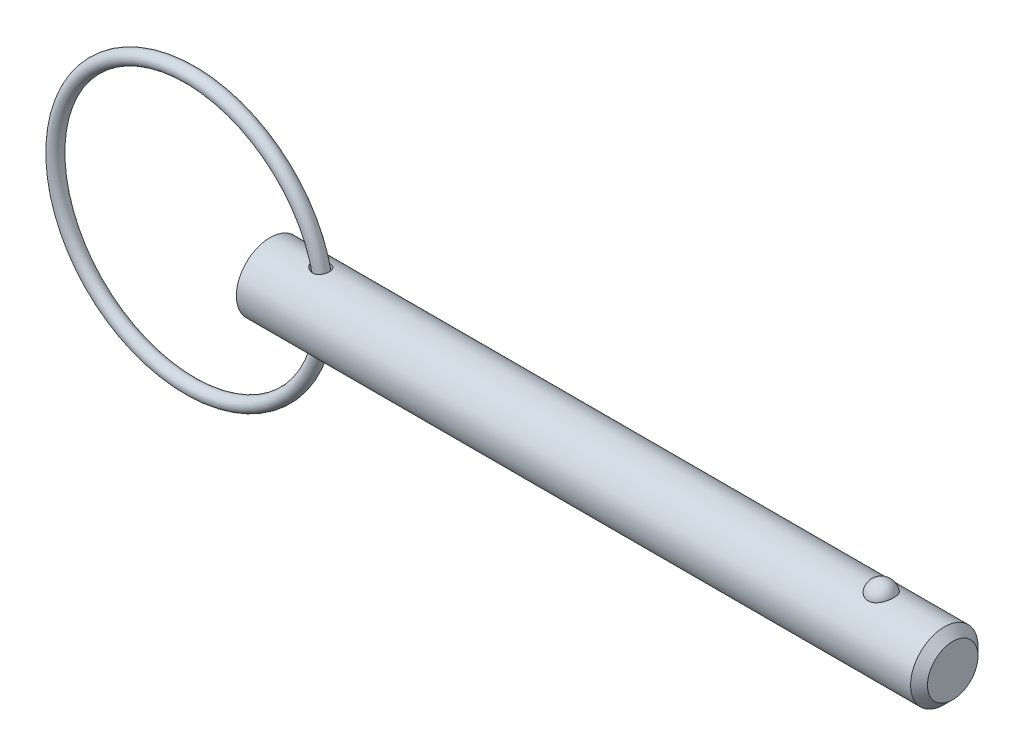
ISO-10303-21;
HEADER;
FILE_DESCRIPTION(('STEP AP214'),'2;1');
FILE_NAME('part.step','',(''),(''),'','','');
FILE_SCHEMA(('AUTOMOTIVE_DESIGN { 1 0 10303 214 1 1 1 1 }'));
ENDSEC;
DATA;
#1=APPLICATION_CONTEXT('core data for automotive mechanical design processes');
#2=APPLICATION_PROTOCOL_DEFINITION('international standard','automotive_design',2000,#1);
#3=PRODUCT_CONTEXT('',#1,'mechanical');
#4=PRODUCT('Part','Part','',(#3));
#5=PRODUCT_RELATED_PRODUCT_CATEGORY('part','',(#4));
#6=PRODUCT_DEFINITION_FORMATION('','',#4);
#7=PRODUCT_DEFINITION_CONTEXT('part definition',#1,'design');
#8=PRODUCT_DEFINITION('design','',#6,#7);
#9=PRODUCT_DEFINITION_SHAPE('','',#8);
#10=(LENGTH_UNIT() NAMED_UNIT(*) SI_UNIT(.MILLI.,.METRE.));
#11=(NAMED_UNIT(*) PLANE_ANGLE_UNIT() SI_UNIT($,.RADIAN.));
#12=(NAMED_UNIT(*) SI_UNIT($,.STERADIAN.) SOLID_ANGLE_UNIT());
#13=UNCERTAINTY_MEASURE_WITH_UNIT(LENGTH_MEASURE(1.E-05),#10,'distance_accuracy_value','');
#14=(GEOMETRIC_REPRESENTATION_CONTEXT(3) GLOBAL_UNCERTAINTY_ASSIGNED_CONTEXT((#13)) GLOBAL_UNIT_ASSIGNED_CONTEXT((#10,
#11,#12)) REPRESENTATION_CONTEXT('',''));
#15=CARTESIAN_POINT('',(0.,0.,0.));
#16=DIRECTION('',(0.,0.,1.));
#17=DIRECTION('',(1.,0.,0.));
#18=AXIS2_PLACEMENT_3D('',#15,#16,#17);
#19=CARTESIAN_POINT('',(-7.52490236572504,0.,0.));
#20=DIRECTION('',(0.,0.,1.));
#21=DIRECTION('',(1.,0.,0.));
#22=AXIS2_PLACEMENT_3D('',#19,#20,#21);
#23=TOROIDAL_SURFACE('',#22,12.7,0.635000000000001);
#24=CARTESIAN_POINT('',(5.81009763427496,0.,0.));
#25=VERTEX_POINT('',#24);
#26=VERTEX_LOOP('',#25);
#27=FACE_BOUND('',#26,.T.);
#28=ADVANCED_FACE('P0_F12',(#27),#23,.T.);
#29=CLOSED_SHELL('',(#28));
#30=MANIFOLD_SOLID_BREP('P0_B1',#29);
#31=CARTESIAN_POINT('',(0.,0.,0.));
#32=DIRECTION('',(1.,0.,0.));
#33=DIRECTION('',(0.,0.,-1.));
#34=AXIS2_PLACEMENT_3D('',#31,#32,#33);
#35=CYLINDRICAL_SURFACE('',#34,3.175);
#36=CARTESIAN_POINT('',(4.01221718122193,3.16142308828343,-0.293307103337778));
#37=CARTESIAN_POINT('',(4.03067993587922,3.15750982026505,-0.335477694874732));
#38=CARTESIAN_POINT('',(4.05297703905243,3.15289835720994,-0.375943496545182));
#39=CARTESIAN_POINT('',(4.10415276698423,3.14284099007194,-0.45240794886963));
#40=CARTESIAN_POINT('',(4.13304477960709,3.13739339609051,-0.488397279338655));
#41=CARTESIAN_POINT('',(4.19615348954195,3.12629932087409,-0.554988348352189));
#42=CARTESIAN_POINT('',(4.23034557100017,3.12065384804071,-0.585613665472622));
#43=CARTESIAN_POINT('',(4.30313282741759,3.10972452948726,-0.641123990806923));
#44=CARTESIAN_POINT('',(4.34172706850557,3.10444060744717,-0.666010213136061));
#45=CARTESIAN_POINT('',(4.42517725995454,3.09444053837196,-0.711079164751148));
#46=CARTESIAN_POINT('',(4.4702815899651,3.08978882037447,-0.730818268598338));
#47=CARTESIAN_POINT('',(4.56327045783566,3.08209858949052,-0.762602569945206));
#48=CARTESIAN_POINT('',(4.61115533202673,3.07906027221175,-0.774646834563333));
#49=CARTESIAN_POINT('',(4.70827322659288,3.0750396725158,-0.790458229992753));
#50=CARTESIAN_POINT('',(4.75750323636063,3.07405312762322,-0.794242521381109));
#51=CARTESIAN_POINT('',(4.85586074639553,3.07433427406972,-0.793155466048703));
#52=CARTESIAN_POINT('',(4.90498828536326,3.07560084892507,-0.788288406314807));
#53=CARTESIAN_POINT('',(4.99830385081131,3.08013122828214,-0.770385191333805));
#54=CARTESIAN_POINT('',(5.04260499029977,3.08325928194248,-0.757902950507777));
#55=CARTESIAN_POINT('',(5.12824625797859,3.09104671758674,-0.72548689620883));
#56=CARTESIAN_POINT('',(5.16958706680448,3.09570574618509,-0.705554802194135));
#57=CARTESIAN_POINT('',(5.24627719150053,3.10576748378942,-0.659813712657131));
#58=CARTESIAN_POINT('',(5.28181038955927,3.11112830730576,-0.634302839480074));
#59=CARTESIAN_POINT('',(5.34802604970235,3.12213947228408,-0.577667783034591));
#60=CARTESIAN_POINT('',(5.37870854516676,3.1277898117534,-0.54654363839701));
#61=CARTESIAN_POINT('',(5.43445707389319,3.13876145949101,-0.479533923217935));
#62=CARTESIAN_POINT('',(5.45951927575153,3.14408254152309,-0.443645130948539));
#63=CARTESIAN_POINT('',(5.50339935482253,3.15381660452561,-0.368122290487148));
#64=CARTESIAN_POINT('',(5.52221691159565,3.15822953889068,-0.328488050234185));
#65=CARTESIAN_POINT('',(5.55335622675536,3.16572312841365,-0.246075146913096));
#66=CARTESIAN_POINT('',(5.56559711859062,3.16878711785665,-0.20326439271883));
#67=CARTESIAN_POINT('',(5.58294807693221,3.17317503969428,-0.11613503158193));
#68=CARTESIAN_POINT('',(5.58805800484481,3.17449893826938,-0.0718163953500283));
#69=CARTESIAN_POINT('',(5.59103306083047,3.17526647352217,0.017234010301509));
#70=CARTESIAN_POINT('',(5.5888730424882,3.17470358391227,0.0619666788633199));
#71=CARTESIAN_POINT('',(5.57730300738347,3.17174350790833,0.150422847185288));
#72=CARTESIAN_POINT('',(5.56789286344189,3.16934628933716,0.194146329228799));
#73=CARTESIAN_POINT('',(5.54204285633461,3.16297605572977,0.279344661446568));
#74=CARTESIAN_POINT('',(5.52560272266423,3.15900298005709,0.320819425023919));
#75=CARTESIAN_POINT('',(5.48608205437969,3.14991364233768,0.400340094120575));
#76=CARTESIAN_POINT('',(5.46300145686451,3.14479736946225,0.438385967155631));
#77=CARTESIAN_POINT('',(5.41080575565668,3.1339965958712,0.509900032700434));
#78=CARTESIAN_POINT('',(5.3817004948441,3.12831302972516,0.543375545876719));
#79=CARTESIAN_POINT('',(5.31818122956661,3.11701107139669,0.604852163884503));
#80=CARTESIAN_POINT('',(5.2837678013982,3.11139267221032,0.632853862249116));
#81=CARTESIAN_POINT('',(5.21096127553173,3.10091904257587,0.682320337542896));
#82=CARTESIAN_POINT('',(5.17261393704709,3.09605639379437,0.703850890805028));
#83=CARTESIAN_POINT('',(5.09274050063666,3.08756769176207,0.740203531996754));
#84=CARTESIAN_POINT('',(5.05121474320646,3.08394150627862,0.755026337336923));
#85=CARTESIAN_POINT('',(4.96650658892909,3.07833156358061,0.777582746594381));
#86=CARTESIAN_POINT('',(4.92333841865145,3.07633606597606,0.785367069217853));
#87=CARTESIAN_POINT('',(4.83627503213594,3.07411756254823,0.794006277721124));
#88=CARTESIAN_POINT('',(4.79237971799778,3.07389479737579,0.794860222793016));
#89=CARTESIAN_POINT('',(4.7037564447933,3.0752087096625,0.789761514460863));
#90=CARTESIAN_POINT('',(4.65904075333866,3.07679607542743,0.783612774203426));
#91=CARTESIAN_POINT('',(4.57116325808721,3.08158486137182,0.764561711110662));
#92=CARTESIAN_POINT('',(4.52800197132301,3.08478681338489,0.751657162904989));
#93=CARTESIAN_POINT('',(4.44149370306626,3.09268658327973,0.718486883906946));
#94=CARTESIAN_POINT('',(4.39831651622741,3.0974680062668,0.697797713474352));
#95=CARTESIAN_POINT('',(4.31591226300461,3.10789270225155,0.649792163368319));
#96=CARTESIAN_POINT('',(4.27668695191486,3.11353635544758,0.622472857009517));
#97=CARTESIAN_POINT('',(4.20182407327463,3.1252888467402,0.560557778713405));
#98=CARTESIAN_POINT('',(4.16638921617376,3.13140725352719,0.525717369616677));
#99=CARTESIAN_POINT('',(4.10227951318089,3.14315144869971,0.450199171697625));
#100=CARTESIAN_POINT('',(4.07360231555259,3.14877740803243,0.409523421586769));
#101=CARTESIAN_POINT('',(4.02575866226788,3.15851130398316,0.32574192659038));
#102=CARTESIAN_POINT('',(4.00615248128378,3.16268619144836,0.282896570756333));
#103=CARTESIAN_POINT('',(3.97532986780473,3.16936826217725,0.194163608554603));
#104=CARTESIAN_POINT('',(3.96410589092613,3.17187694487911,0.148278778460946));
#105=CARTESIAN_POINT('',(3.95155037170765,3.17469339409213,0.0604600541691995));
#106=CARTESIAN_POINT('',(3.9492378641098,3.17521926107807,0.0186712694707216));
#107=CARTESIAN_POINT('',(3.95191506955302,3.1746144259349,-0.0646295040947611));
#108=CARTESIAN_POINT('',(3.9568961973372,3.17348567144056,-0.106141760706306));
#109=CARTESIAN_POINT('',(3.97060099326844,3.17043701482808,-0.172031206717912));
#110=CARTESIAN_POINT('',(3.97717137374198,3.16898333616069,-0.196902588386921));
#111=CARTESIAN_POINT('',(3.99283717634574,3.16556630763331,-0.245794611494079));
#112=CARTESIAN_POINT('',(4.00193224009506,3.16360303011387,-0.269815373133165));
#113=CARTESIAN_POINT('',(4.01221718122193,3.16142308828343,-0.293307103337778));
#114=B_SPLINE_CURVE_WITH_KNOTS('',3,(#36,#37,#38,#39,#40,#41,#42,#43,#44,#45,#46,#47,#48,#49,
#50,#51,#52,#53,#54,#55,#56,#57,#58,#59,#60,#61,#62,#63,#64,#65,#66,#67,#68,#69,#70,#71,#72,#73,
#74,#75,#76,#77,#78,#79,#80,#81,#82,#83,#84,#85,#86,#87,#88,#89,#90,#91,#92,#93,#94,#95,#96,#97,
#98,#99,#100,#101,#102,#103,#104,#105,#106,#107,#108,#109,#110,#111,#112,#113),.UNSPECIFIED.,
.T.,.F.,(4,2,2,2,2,2,2,2,2,2,2,2,2,2,2,2,2,2,2,2,2,2,2,2,2,2,2,2,2,2,2,2,2,2,2,2,2,2,4),(0.,
0.138498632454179,0.277280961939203,0.415437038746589,0.553563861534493,0.701231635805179,
0.848917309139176,0.996295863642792,1.14360140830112,1.28129260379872,1.41895203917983,
1.55053732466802,1.68212170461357,1.81379551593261,1.9454760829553,2.07874074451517,
2.21200799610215,2.34573668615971,2.47946772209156,2.61320390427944,2.74694135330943,
2.8804620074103,3.01396817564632,3.14606745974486,3.27815261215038,3.40927820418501,
3.54042159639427,3.6753294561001,3.81028178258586,3.95399377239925,4.09776931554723,
4.24721954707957,4.39661769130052,4.53771923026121,4.67869361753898,4.80361432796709,
4.92838811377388,5.00555170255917,5.08270434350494),.UNSPECIFIED.);
#115=CARTESIAN_POINT('',(4.01221718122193,3.16142308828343,-0.293307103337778));
#116=VERTEX_POINT('',#115);
#117=EDGE_CURVE('P1_E40',#116,#116,#114,.T.);
#118=ORIENTED_EDGE('',*,*,#117,.T.);
#119=EDGE_LOOP('',(#118));
#120=FACE_BOUND('',#119,.T.);
#121=CARTESIAN_POINT('',(63.51625,0.,0.));
#122=DIRECTION('',(1.,0.,0.));
#123=DIRECTION('',(0.,0.,-1.));
#124=AXIS2_PLACEMENT_3D('',#121,#122,#123);
#125=CIRCLE('',#124,3.175);
#126=CARTESIAN_POINT('',(63.51625,0.,-3.175));
#127=VERTEX_POINT('',#126);
#128=EDGE_CURVE('P1_E25',#127,#127,#125,.T.);
#129=ORIENTED_EDGE('',*,*,#128,.F.);
#130=EDGE_LOOP('',(#129));
#131=FACE_BOUND('',#130,.T.);
#132=CARTESIAN_POINT('',(0.,0.,0.));
#133=DIRECTION('',(1.,0.,0.));
#134=DIRECTION('',(0.,0.,-1.));
#135=AXIS2_PLACEMENT_3D('',#132,#133,#134);
#136=CIRCLE('',#135,3.175);
#137=CARTESIAN_POINT('',(0.,0.,-3.175));
#138=VERTEX_POINT('',#137);
#139=EDGE_CURVE('P1_E9',#138,#138,#136,.T.);
#140=ORIENTED_EDGE('',*,*,#139,.T.);
#141=EDGE_LOOP('',(#140));
#142=FACE_BOUND('',#141,.T.);
#143=CARTESIAN_POINT('',(57.5757276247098,2.92898950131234,1.2254164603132));
#144=CARTESIAN_POINT('',(57.512316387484,2.92899434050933,1.22541146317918));
#145=CARTESIAN_POINT('',(57.4487979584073,2.93112688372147,1.22034641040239));
#146=CARTESIAN_POINT('',(57.3235306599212,2.93942752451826,1.2002094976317));
#147=CARTESIAN_POINT('',(57.2617869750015,2.9456063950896,1.1851109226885));
#148=CARTESIAN_POINT('',(57.1420651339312,2.96127115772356,1.14540352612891));
#149=CARTESIAN_POINT('',(57.0840775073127,2.97074831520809,1.12081980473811));
#150=CARTESIAN_POINT('',(56.9731943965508,2.99197584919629,1.06285154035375));
#151=CARTESIAN_POINT('',(56.9202966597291,3.0037252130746,1.02947091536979));
#152=CARTESIAN_POINT('',(56.8192688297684,3.02865714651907,0.95367409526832));
#153=CARTESIAN_POINT('',(56.771324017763,3.04187163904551,0.911021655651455));
#154=CARTESIAN_POINT('',(56.6830360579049,3.06808741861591,0.818400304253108));
#155=CARTESIAN_POINT('',(56.6426952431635,3.08108863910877,0.768429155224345));
#156=CARTESIAN_POINT('',(56.5688039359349,3.10614903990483,0.660064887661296));
#157=CARTESIAN_POINT('',(56.5356330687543,3.11814104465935,0.60139688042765));
#158=CARTESIAN_POINT('',(56.4791190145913,3.13926931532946,0.479026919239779));
#159=CARTESIAN_POINT('',(56.4557764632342,3.14840539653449,0.415324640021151));
#160=CARTESIAN_POINT('',(56.4191785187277,3.16298160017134,0.283885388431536));
#161=CARTESIAN_POINT('',(56.4060407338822,3.16837855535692,0.216110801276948));
#162=CARTESIAN_POINT('',(56.3905676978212,3.17475386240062,0.0791367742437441));
#163=CARTESIAN_POINT('',(56.388232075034,3.17573236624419,0.00993738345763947));
#164=CARTESIAN_POINT('',(56.394388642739,3.17318075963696,-0.127420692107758));
#165=CARTESIAN_POINT('',(56.4028073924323,3.16968122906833,-0.195583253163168));
#166=CARTESIAN_POINT('',(56.4301752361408,3.1585790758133,-0.329413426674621));
#167=CARTESIAN_POINT('',(56.4491245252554,3.15097637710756,-0.395080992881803));
#168=CARTESIAN_POINT('',(56.4972057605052,3.13242485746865,-0.522180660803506));
#169=CARTESIAN_POINT('',(56.5263524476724,3.12147119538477,-0.583606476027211));
#170=CARTESIAN_POINT('',(56.5942352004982,3.09734973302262,-0.700436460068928));
#171=CARTESIAN_POINT('',(56.632972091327,3.08418174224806,-0.755840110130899));
#172=CARTESIAN_POINT('',(56.7194771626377,3.05694884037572,-0.85940454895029));
#173=CARTESIAN_POINT('',(56.7672961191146,3.04287919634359,-0.907521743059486));
#174=CARTESIAN_POINT('',(56.8707353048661,3.01548927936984,-0.994758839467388));
#175=CARTESIAN_POINT('',(56.9263549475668,3.0021689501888,-1.03387941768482));
#176=CARTESIAN_POINT('',(57.0428093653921,2.97810316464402,-1.10126594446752));
#177=CARTESIAN_POINT('',(57.1035182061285,2.96731170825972,-1.12973256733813));
#178=CARTESIAN_POINT('',(57.2293712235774,2.94928934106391,-1.17598467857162));
#179=CARTESIAN_POINT('',(57.2945137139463,2.94205708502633,-1.19377420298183));
#180=CARTESIAN_POINT('',(57.4238562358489,2.93233065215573,-1.21746387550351));
#181=CARTESIAN_POINT('',(57.4879385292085,2.92961621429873,-1.22391763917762));
#182=CARTESIAN_POINT('',(57.6163375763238,2.92855752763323,-1.22644976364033));
#183=CARTESIAN_POINT('',(57.680654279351,2.93021238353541,-1.22253024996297));
#184=CARTESIAN_POINT('',(57.8055239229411,2.93756851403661,-1.20474140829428));
#185=CARTESIAN_POINT('',(57.866131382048,2.94313790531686,-1.1911962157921));
#186=CARTESIAN_POINT('',(57.9841106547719,2.95756226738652,-1.15491492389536));
#187=CARTESIAN_POINT('',(58.0414822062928,2.96641750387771,-1.13217808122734));
#188=CARTESIAN_POINT('',(58.1527699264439,2.98669918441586,-1.07755083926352));
#189=CARTESIAN_POINT('',(58.2065845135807,2.9981771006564,-1.04547308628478));
#190=CARTESIAN_POINT('',(58.3081473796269,3.02240235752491,-0.973220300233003));
#191=CARTESIAN_POINT('',(58.3558942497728,3.03514999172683,-0.933043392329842));
#192=CARTESIAN_POINT('',(58.4465817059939,3.06131230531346,-0.843372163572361));
#193=CARTESIAN_POINT('',(58.4891588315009,3.07472822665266,-0.793510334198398));
#194=CARTESIAN_POINT('',(58.5656765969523,3.10021106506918,-0.687241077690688));
#195=CARTESIAN_POINT('',(58.5996156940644,3.1122777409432,-0.630832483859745));
#196=CARTESIAN_POINT('',(58.6591209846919,3.134208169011,-0.51105938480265));
#197=CARTESIAN_POINT('',(58.6843892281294,3.14399040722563,-0.4475315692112));
#198=CARTESIAN_POINT('',(58.7245117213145,3.15983820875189,-0.316827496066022));
#199=CARTESIAN_POINT('',(58.7393659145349,3.16590375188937,-0.249651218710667));
#200=CARTESIAN_POINT('',(58.758358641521,3.17370076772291,-0.113549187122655));
#201=CARTESIAN_POINT('',(58.7624966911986,3.17543204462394,-0.0446233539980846));
#202=CARTESIAN_POINT('',(58.7599697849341,3.17438372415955,0.0929938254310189));
#203=CARTESIAN_POINT('',(58.753305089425,3.17160423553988,0.161685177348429));
#204=CARTESIAN_POINT('',(58.7293754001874,3.1618438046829,0.296502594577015));
#205=CARTESIAN_POINT('',(58.7121674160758,3.15488546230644,0.36264043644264));
#206=CARTESIAN_POINT('',(58.667547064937,3.13748892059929,0.490896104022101));
#207=CARTESIAN_POINT('',(58.6401339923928,3.12705048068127,0.553013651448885));
#208=CARTESIAN_POINT('',(58.5754626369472,3.10369139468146,0.671876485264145));
#209=CARTESIAN_POINT('',(58.5381467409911,3.0907563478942,0.728587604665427));
#210=CARTESIAN_POINT('',(58.4545246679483,3.06381731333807,0.834653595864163));
#211=CARTESIAN_POINT('',(58.4082189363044,3.04981337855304,0.884008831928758));
#212=CARTESIAN_POINT('',(58.3077184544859,3.02230423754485,0.973916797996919));
#213=CARTESIAN_POINT('',(58.253535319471,3.00879833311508,1.01448227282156));
#214=CARTESIAN_POINT('',(58.1385299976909,2.98383625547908,1.08571550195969));
#215=CARTESIAN_POINT('',(58.0777053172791,2.9723808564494,1.11637952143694));
#216=CARTESIAN_POINT('',(57.9533690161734,2.95329063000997,1.16592590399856));
#217=CARTESIAN_POINT('',(57.8900230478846,2.9455373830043,1.18517901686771));
#218=CARTESIAN_POINT('',(57.7607664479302,2.9342556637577,1.21284802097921));
#219=CARTESIAN_POINT('',(57.6948641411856,2.93071450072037,1.2212964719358));
#220=CARTESIAN_POINT('',(57.611116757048,2.9291525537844,1.22502505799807));
#221=CARTESIAN_POINT('',(57.5934263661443,2.9289881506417,1.22541785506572));
#222=CARTESIAN_POINT('',(57.5757276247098,2.92898950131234,1.2254164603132));
#223=B_SPLINE_CURVE_WITH_KNOTS('',3,(#143,#144,#145,#146,#147,#148,#149,#150,#151,#152,#153,
#154,#155,#156,#157,#158,#159,#160,#161,#162,#163,#164,#165,#166,#167,#168,#169,#170,#171,#172,
#173,#174,#175,#176,#177,#178,#179,#180,#181,#182,#183,#184,#185,#186,#187,#188,#189,#190,#191,
#192,#193,#194,#195,#196,#197,#198,#199,#200,#201,#202,#203,#204,#205,#206,#207,#208,#209,#210,
#211,#212,#213,#214,#215,#216,#217,#218,#219,#220,#221,#222),.UNSPECIFIED.,.T.,.F.,(4,2,2,2,2,2,
2,2,2,2,2,2,2,2,2,2,2,2,2,2,2,2,2,2,2,2,2,2,2,2,2,2,2,2,2,2,2,2,2,4),(0.,0.190186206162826,
0.380880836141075,0.571074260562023,0.761183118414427,0.95686644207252,1.1526097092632,
1.35701770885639,1.56143892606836,1.76818248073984,1.97491892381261,2.18025109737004,
2.38558707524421,2.59122111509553,2.79687285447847,3.0037101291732,3.21053185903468,
3.41323429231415,3.61586005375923,3.80828192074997,4.00066436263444,4.18685798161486,
4.37306665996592,4.56330302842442,4.75358348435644,4.95345287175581,5.15335793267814,
5.35957003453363,5.56578325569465,5.77200579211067,5.97822335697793,6.18333558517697,
6.38846199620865,6.59480900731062,6.80114579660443,7.0071813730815,7.21329457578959,
7.41228022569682,7.61066481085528,7.66374777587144),.UNSPECIFIED.);
#224=CARTESIAN_POINT('',(57.5757276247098,2.92898950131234,1.2254164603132));
#225=VERTEX_POINT('',#224);
#226=EDGE_CURVE('P1_E34',#225,#225,#223,.T.);
#227=ORIENTED_EDGE('',*,*,#226,.T.);
#228=EDGE_LOOP('',(#227));
#229=FACE_BOUND('',#228,.T.);
#230=CARTESIAN_POINT('',(4.01221718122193,-3.16142308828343,-0.293307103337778));
#231=CARTESIAN_POINT('',(3.99616924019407,-3.16482429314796,-0.256648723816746));
#232=CARTESIAN_POINT('',(3.98300872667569,-3.16769953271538,-0.218679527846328));
#233=CARTESIAN_POINT('',(3.96305928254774,-3.17210414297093,-0.141027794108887));
#234=CARTESIAN_POINT('',(3.95626715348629,-3.17363418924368,-0.101346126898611));
#235=CARTESIAN_POINT('',(3.94940055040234,-3.17518116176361,-0.0213063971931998));
#236=CARTESIAN_POINT('',(3.94933713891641,-3.17519559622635,0.019052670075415));
#237=CARTESIAN_POINT('',(3.95595884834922,-3.173703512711,0.0991848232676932));
#238=CARTESIAN_POINT('',(3.96264478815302,-3.17219681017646,0.138957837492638));
#239=CARTESIAN_POINT('',(3.98225001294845,-3.16786598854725,0.216153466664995));
#240=CARTESIAN_POINT('',(3.99506606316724,-3.16506371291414,0.253603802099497));
#241=CARTESIAN_POINT('',(4.0263107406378,-3.15843101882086,0.325977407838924));
#242=CARTESIAN_POINT('',(4.04474073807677,-3.15460034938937,0.360900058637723));
#243=CARTESIAN_POINT('',(4.08796442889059,-3.14597426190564,0.429836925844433));
#244=CARTESIAN_POINT('',(4.11310717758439,-3.1411307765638,0.463625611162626));
#245=CARTESIAN_POINT('',(4.16818460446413,-3.13112506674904,0.526983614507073));
#246=CARTESIAN_POINT('',(4.19812149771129,-3.1259626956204,0.556550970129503));
#247=CARTESIAN_POINT('',(4.26550089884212,-3.11521604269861,0.614003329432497));
#248=CARTESIAN_POINT('',(4.3034063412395,-3.10964747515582,0.641349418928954));
#249=CARTESIAN_POINT('',(4.38313680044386,-3.09926692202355,0.68977116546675));
#250=CARTESIAN_POINT('',(4.42496355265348,-3.09445527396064,0.710844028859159));
#251=CARTESIAN_POINT('',(4.5141785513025,-3.08586578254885,0.747282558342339));
#252=CARTESIAN_POINT('',(4.5617504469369,-3.08216903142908,0.762221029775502));
#253=CARTESIAN_POINT('',(4.65884938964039,-3.076742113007,0.783842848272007));
#254=CARTESIAN_POINT('',(4.7083760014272,-3.07501151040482,0.790528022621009));
#255=CARTESIAN_POINT('',(4.80630979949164,-3.07383938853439,0.7950736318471));
#256=CARTESIAN_POINT('',(4.85470314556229,-3.07432752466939,0.793205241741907));
#257=CARTESIAN_POINT('',(4.95034305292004,-3.07744489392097,0.781023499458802));
#258=CARTESIAN_POINT('',(4.99759012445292,-3.0800731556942,0.770713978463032));
#259=CARTESIAN_POINT('',(5.08626194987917,-3.08693276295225,0.742738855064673));
#260=CARTESIAN_POINT('',(5.1278649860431,-3.09104603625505,0.725607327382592));
#261=CARTESIAN_POINT('',(5.20739903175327,-3.10040746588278,0.684500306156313));
#262=CARTESIAN_POINT('',(5.24533051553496,-3.10565547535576,0.660525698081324));
#263=CARTESIAN_POINT('',(5.31542898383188,-3.11652031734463,0.607160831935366));
#264=CARTESIAN_POINT('',(5.34772618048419,-3.12212297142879,0.577938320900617));
#265=CARTESIAN_POINT('',(5.40696901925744,-3.13320503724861,0.514477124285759));
#266=CARTESIAN_POINT('',(5.43391452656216,-3.13868444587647,0.480238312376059));
#267=CARTESIAN_POINT('',(5.4820017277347,-3.14897211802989,0.407384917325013));
#268=CARTESIAN_POINT('',(5.50309185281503,-3.15377424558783,0.368735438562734));
#269=CARTESIAN_POINT('',(5.53866240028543,-3.16213411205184,0.288380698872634));
#270=CARTESIAN_POINT('',(5.55314252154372,-3.16569179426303,0.246675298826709));
#271=CARTESIAN_POINT('',(5.57526489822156,-3.17121134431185,0.160950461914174));
#272=CARTESIAN_POINT('',(5.58283917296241,-3.17315732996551,0.116912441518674));
#273=CARTESIAN_POINT('',(5.59072863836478,-3.17518554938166,0.0281485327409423));
#274=CARTESIAN_POINT('',(5.59104374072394,-3.17526776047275,-0.0165773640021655));
#275=CARTESIAN_POINT('',(5.58440302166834,-3.17355847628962,-0.105510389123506));
#276=CARTESIAN_POINT('',(5.57743745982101,-3.17176447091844,-0.149716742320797));
#277=CARTESIAN_POINT('',(5.55638330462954,-3.16649194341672,-0.23629572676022));
#278=CARTESIAN_POINT('',(5.54229454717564,-3.16301338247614,-0.278668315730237));
#279=CARTESIAN_POINT('',(5.50732506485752,-3.15474878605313,-0.360378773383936));
#280=CARTESIAN_POINT('',(5.48644386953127,-3.14996266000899,-0.399716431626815));
#281=CARTESIAN_POINT('',(5.43839310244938,-3.13960947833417,-0.474229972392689));
#282=CARTESIAN_POINT('',(5.41122365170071,-3.1340424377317,-0.509405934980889));
#283=CARTESIAN_POINT('',(5.35140258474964,-3.12277449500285,-0.574449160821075));
#284=CARTESIAN_POINT('',(5.31877354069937,-3.11707422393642,-0.604337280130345));
#285=CARTESIAN_POINT('',(5.24883067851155,-3.10616541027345,-0.658116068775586));
#286=CARTESIAN_POINT('',(5.21151752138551,-3.1009567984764,-0.682007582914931));
#287=CARTESIAN_POINT('',(5.13375489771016,-3.09168295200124,-0.722881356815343));
#288=CARTESIAN_POINT('',(5.09335030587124,-3.0876042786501,-0.739946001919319));
#289=CARTESIAN_POINT('',(5.01017421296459,-3.08094605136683,-0.767199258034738));
#290=CARTESIAN_POINT('',(4.96740279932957,-3.07836644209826,-0.777388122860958));
#291=CARTESIAN_POINT('',(4.88066362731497,-3.07495302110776,-0.790782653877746));
#292=CARTESIAN_POINT('',(4.8366943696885,-3.07412150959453,-0.793979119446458));
#293=CARTESIAN_POINT('',(4.74880185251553,-3.07424620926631,-0.79349509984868));
#294=CARTESIAN_POINT('',(4.70487860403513,-3.07520278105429,-0.789813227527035));
#295=CARTESIAN_POINT('',(4.61626456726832,-3.07882608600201,-0.775571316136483));
#296=CARTESIAN_POINT('',(4.571624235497,-3.08156578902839,-0.764717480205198));
#297=CARTESIAN_POINT('',(4.48464592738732,-3.08847909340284,-0.736297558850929));
#298=CARTESIAN_POINT('',(4.44230893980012,-3.09265330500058,-0.718728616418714));
#299=CARTESIAN_POINT('',(4.35823256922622,-3.10228551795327,-0.675988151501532));
#300=CARTESIAN_POINT('',(4.31671586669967,-3.10780992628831,-0.650392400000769));
#301=CARTESIAN_POINT('',(4.23853942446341,-3.11932897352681,-0.592684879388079));
#302=CARTESIAN_POINT('',(4.20188053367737,-3.12532369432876,-0.560571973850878));
#303=CARTESIAN_POINT('',(4.13583653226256,-3.13687565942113,-0.491740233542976));
#304=CARTESIAN_POINT('',(4.10623659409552,-3.14244088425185,-0.455229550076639));
#305=CARTESIAN_POINT('',(4.05384351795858,-3.1527191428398,-0.377513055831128));
#306=CARTESIAN_POINT('',(4.03104346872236,-3.1574330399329,-0.336312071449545));
#307=CARTESIAN_POINT('',(4.01221718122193,-3.16142308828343,-0.293307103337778));
#308=B_SPLINE_CURVE_WITH_KNOTS('',3,(#230,#231,#232,#233,#234,#235,#236,#237,#238,#239,#240,
#241,#242,#243,#244,#245,#246,#247,#248,#249,#250,#251,#252,#253,#254,#255,#256,#257,#258,#259,
#260,#261,#262,#263,#264,#265,#266,#267,#268,#269,#270,#271,#272,#273,#274,#275,#276,#277,#278,
#279,#280,#281,#282,#283,#284,#285,#286,#287,#288,#289,#290,#291,#292,#293,#294,#295,#296,#297,
#298,#299,#300,#301,#302,#303,#304,#305,#306,#307),.UNSPECIFIED.,.T.,.F.,(4,2,2,2,2,2,2,2,2,2,2,
2,2,2,2,2,2,2,2,2,2,2,2,2,2,2,2,2,2,2,2,2,2,2,2,2,2,2,4),(0.,0.120338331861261,
0.240616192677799,0.361091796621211,0.481582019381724,0.60011096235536,0.718668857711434,
0.845336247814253,0.972062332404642,1.1126676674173,1.25333552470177,1.40259505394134,
1.55182153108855,1.69635040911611,1.84081372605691,1.97568175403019,2.11053233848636,
2.24166080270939,2.37279256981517,2.50504501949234,2.63730349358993,2.77085027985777,
2.90439869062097,3.03812599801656,3.17185638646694,3.30559603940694,3.43933311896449,
3.57253035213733,3.70570880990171,3.83722775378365,3.96874184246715,4.10042887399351,
4.23214246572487,4.36961700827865,4.5071501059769,4.65373408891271,4.80034365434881,
4.94166003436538,5.08283228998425),.UNSPECIFIED.);
#309=CARTESIAN_POINT('',(4.01221718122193,-3.16142308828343,-0.293307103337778));
#310=VERTEX_POINT('',#309);
#311=EDGE_CURVE('P1_E17',#310,#310,#308,.T.);
#312=ORIENTED_EDGE('',*,*,#311,.T.);
#313=EDGE_LOOP('',(#312));
#314=FACE_BOUND('',#313,.T.);
#315=ADVANCED_FACE('P1_F13',(#120,#131,#142,#229,#314),#35,.T.);
#316=CARTESIAN_POINT('',(0.,0.,0.));
#317=DIRECTION('',(-1.,0.,0.));
#318=DIRECTION('',(0.,0.,1.));
#319=AXIS2_PLACEMENT_3D('',#316,#317,#318);
#320=PLANE('',#319);
#321=ORIENTED_EDGE('',*,*,#139,.F.);
#322=EDGE_LOOP('',(#321));
#323=FACE_BOUND('',#322,.T.);
#324=ADVANCED_FACE('P1_F15',(#323),#320,.T.);
#325=CARTESIAN_POINT('',(64.31,0.,0.));
#326=DIRECTION('',(-1.,0.,0.));
#327=DIRECTION('',(0.,0.,1.));
#328=AXIS2_PLACEMENT_3D('',#325,#326,#327);
#329=CONICAL_SURFACE('',#328,2.38125000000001,0.785398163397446);
#330=ORIENTED_EDGE('',*,*,#128,.T.);
#331=EDGE_LOOP('',(#330));
#332=FACE_BOUND('',#331,.T.);
#333=CARTESIAN_POINT('',(64.31,0.,0.));
#334=DIRECTION('',(1.,0.,0.));
#335=DIRECTION('',(0.,0.,-1.));
#336=AXIS2_PLACEMENT_3D('',#333,#334,#335);
#337=CIRCLE('',#336,2.38125000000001);
#338=CARTESIAN_POINT('',(64.31,0.,-2.38125000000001));
#339=VERTEX_POINT('',#338);
#340=EDGE_CURVE('P1_E30',#339,#339,#337,.T.);
#341=ORIENTED_EDGE('',*,*,#340,.F.);
#342=EDGE_LOOP('',(#341));
#343=FACE_BOUND('',#342,.T.);
#344=ADVANCED_FACE('P1_F55',(#332,#343),#329,.T.);
#345=CARTESIAN_POINT('',(64.31,2.38125000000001,0.));
#346=DIRECTION('',(1.,0.,0.));
#347=DIRECTION('',(0.,0.,-1.));
#348=AXIS2_PLACEMENT_3D('',#345,#346,#347);
#349=PLANE('',#348);
#350=ORIENTED_EDGE('',*,*,#340,.T.);
#351=EDGE_LOOP('',(#350));
#352=FACE_BOUND('',#351,.T.);
#353=ADVANCED_FACE('P1_F51',(#352),#349,.T.);
#354=CARTESIAN_POINT('',(57.5757276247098,2.8575,0.));
#355=DIRECTION('',(-1.,0.,0.));
#356=DIRECTION('',(0.,1.,0.));
#357=AXIS2_PLACEMENT_3D('',#354,#355,#356);
#358=SPHERICAL_SURFACE('',#357,1.2275);
#359=ORIENTED_EDGE('',*,*,#226,.F.);
#360=EDGE_LOOP('',(#359));
#361=FACE_BOUND('',#360,.T.);
#362=ADVANCED_FACE('P1_F46',(#361),#358,.T.);
#363=CARTESIAN_POINT('',(-7.52490236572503,0.,0.));
#364=DIRECTION('',(0.,0.,1.));
#365=DIRECTION('',(1.,0.,0.));
#366=AXIS2_PLACEMENT_3D('',#363,#364,#365);
#367=TOROIDAL_SURFACE('',#366,12.7,0.79375);
#368=ORIENTED_EDGE('',*,*,#311,.F.);
#369=EDGE_LOOP('',(#368));
#370=FACE_BOUND('',#369,.T.);
#371=ORIENTED_EDGE('',*,*,#117,.F.);
#372=EDGE_LOOP('',(#371));
#373=FACE_BOUND('',#372,.T.);
#374=ADVANCED_FACE('P1_F50',(#370,#373),#367,.F.);
#375=CLOSED_SHELL('',(#315,#324,#344,#353,#362,#374));
#376=MANIFOLD_SOLID_BREP('P1_B1',#375);
#377=ADVANCED_BREP_SHAPE_REPRESENTATION('',(#18,#30,#376),#14);
#378=SHAPE_DEFINITION_REPRESENTATION(#9,#377);
ENDSEC;
END-ISO-10303-21;
